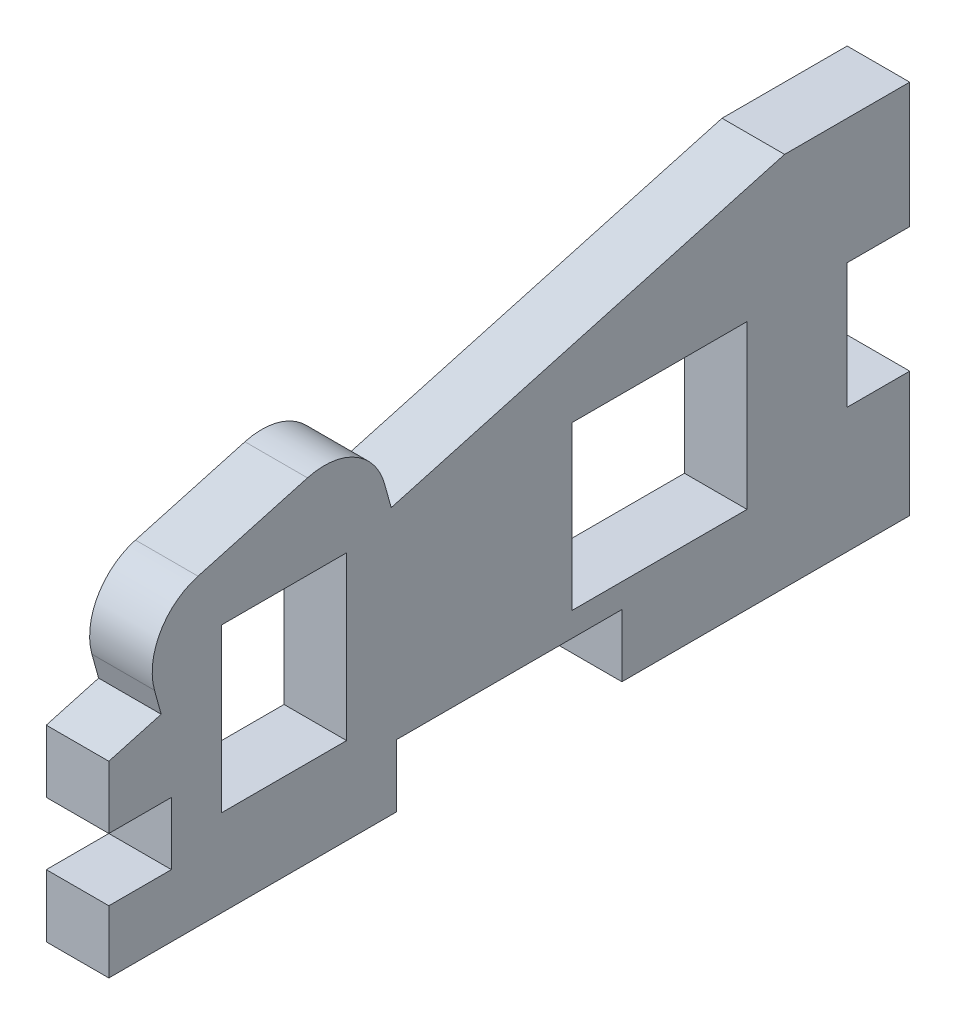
ISO-10303-21;
HEADER;
FILE_DESCRIPTION(('STEP AP214'),'2;1');
FILE_NAME('part.step','',(''),(''),'','','');
FILE_SCHEMA(('AUTOMOTIVE_DESIGN { 1 0 10303 214 1 1 1 1 }'));
ENDSEC;
DATA;
#1=APPLICATION_CONTEXT('core data for automotive mechanical design processes');
#2=APPLICATION_PROTOCOL_DEFINITION('international standard','automotive_design',2000,#1);
#3=PRODUCT_CONTEXT('',#1,'mechanical');
#4=PRODUCT('Part','Part','',(#3));
#5=PRODUCT_RELATED_PRODUCT_CATEGORY('part','',(#4));
#6=PRODUCT_DEFINITION_FORMATION('','',#4);
#7=PRODUCT_DEFINITION_CONTEXT('part definition',#1,'design');
#8=PRODUCT_DEFINITION('design','',#6,#7);
#9=PRODUCT_DEFINITION_SHAPE('','',#8);
#10=(LENGTH_UNIT() NAMED_UNIT(*) SI_UNIT(.MILLI.,.METRE.));
#11=(NAMED_UNIT(*) PLANE_ANGLE_UNIT() SI_UNIT($,.RADIAN.));
#12=(NAMED_UNIT(*) SI_UNIT($,.STERADIAN.) SOLID_ANGLE_UNIT());
#13=UNCERTAINTY_MEASURE_WITH_UNIT(LENGTH_MEASURE(1.E-05),#10,'distance_accuracy_value','');
#14=(GEOMETRIC_REPRESENTATION_CONTEXT(3) GLOBAL_UNCERTAINTY_ASSIGNED_CONTEXT((#13)) GLOBAL_UNIT_ASSIGNED_CONTEXT((#10,
#11,#12)) REPRESENTATION_CONTEXT('',''));
#15=CARTESIAN_POINT('',(0.,0.,0.));
#16=DIRECTION('',(0.,0.,1.));
#17=DIRECTION('',(1.,0.,0.));
#18=AXIS2_PLACEMENT_3D('',#15,#16,#17);
#19=CARTESIAN_POINT('',(5.,5.,19.6666666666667));
#20=DIRECTION('',(0.,-0.963517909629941,-0.267643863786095));
#21=DIRECTION('',(0.,0.267643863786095,-0.963517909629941));
#22=AXIS2_PLACEMENT_3D('',#19,#20,#21);
#23=PLANE('',#22);
#24=DIRECTION('',(0.,-0.267643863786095,0.963517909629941));
#25=VECTOR('',#24,1.);
#26=CARTESIAN_POINT('',(5.,5.,19.6666666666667));
#27=LINE('',#26,#25);
#28=CARTESIAN_POINT('',(5.,6.16178068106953,15.4842562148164));
#29=VERTEX_POINT('',#28);
#30=CARTESIAN_POINT('',(5.,5.,19.6666666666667));
#31=VERTEX_POINT('',#30);
#32=EDGE_CURVE('E417',#29,#31,#27,.T.);
#33=ORIENTED_EDGE('',*,*,#32,.F.);
#34=DIRECTION('',(1.,0.,0.));
#35=VECTOR('',#34,1.);
#36=CARTESIAN_POINT('',(-23.468724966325,6.16178068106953,15.4842562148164));
#37=LINE('',#36,#35);
#38=CARTESIAN_POINT('',(0.,6.16178068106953,15.4842562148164));
#39=VERTEX_POINT('',#38);
#40=EDGE_CURVE('E262',#39,#29,#37,.T.);
#41=ORIENTED_EDGE('',*,*,#40,.F.);
#42=DIRECTION('',(0.,-0.267643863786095,0.963517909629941));
#43=VECTOR('',#42,1.);
#44=CARTESIAN_POINT('',(0.,5.,19.6666666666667));
#45=LINE('',#44,#43);
#46=CARTESIAN_POINT('',(0.,5.,19.6666666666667));
#47=VERTEX_POINT('',#46);
#48=EDGE_CURVE('E433',#39,#47,#45,.T.);
#49=ORIENTED_EDGE('',*,*,#48,.T.);
#50=DIRECTION('',(-1.,0.,0.));
#51=VECTOR('',#50,1.);
#52=CARTESIAN_POINT('',(5.,5.,19.6666666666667));
#53=LINE('',#52,#51);
#54=EDGE_CURVE('E446',#31,#47,#53,.T.);
#55=ORIENTED_EDGE('',*,*,#54,.F.);
#56=EDGE_LOOP('',(#33,#41,#49,#55));
#57=FACE_BOUND('',#56,.T.);
#58=ADVANCED_FACE('F32',(#57),#23,.F.);
#59=CARTESIAN_POINT('',(5.,5.,19.6666666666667));
#60=DIRECTION('',(0.,0.,-1.));
#61=DIRECTION('',(0.,1.,0.));
#62=AXIS2_PLACEMENT_3D('',#59,#60,#61);
#63=PLANE('',#62);
#64=DIRECTION('',(0.,-1.,0.));
#65=VECTOR('',#64,1.);
#66=CARTESIAN_POINT('',(0.,5.,19.6666666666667));
#67=LINE('',#66,#65);
#68=CARTESIAN_POINT('',(0.,0.,19.6666666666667));
#69=VERTEX_POINT('',#68);
#70=EDGE_CURVE('E438',#47,#69,#67,.T.);
#71=ORIENTED_EDGE('',*,*,#70,.T.);
#72=DIRECTION('',(1.,0.,0.));
#73=VECTOR('',#72,1.);
#74=CARTESIAN_POINT('',(0.,0.,19.6666666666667));
#75=LINE('',#74,#73);
#76=CARTESIAN_POINT('',(5.,0.,19.6666666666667));
#77=VERTEX_POINT('',#76);
#78=EDGE_CURVE('E326',#69,#77,#75,.T.);
#79=ORIENTED_EDGE('',*,*,#78,.T.);
#80=DIRECTION('',(0.,-1.,0.));
#81=VECTOR('',#80,1.);
#82=CARTESIAN_POINT('',(5.,5.,19.6666666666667));
#83=LINE('',#82,#81);
#84=EDGE_CURVE('E422',#31,#77,#83,.T.);
#85=ORIENTED_EDGE('',*,*,#84,.F.);
#86=ORIENTED_EDGE('',*,*,#54,.T.);
#87=EDGE_LOOP('',(#71,#79,#85,#86));
#88=FACE_BOUND('',#87,.T.);
#89=ADVANCED_FACE('F501',(#88),#63,.F.);
#90=CARTESIAN_POINT('',(5.,-10.,19.6666666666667));
#91=DIRECTION('',(0.,1.,0.));
#92=DIRECTION('',(0.,0.,1.));
#93=AXIS2_PLACEMENT_3D('',#90,#91,#92);
#94=PLANE('',#93);
#95=DIRECTION('',(0.,0.,-1.));
#96=VECTOR('',#95,1.);
#97=CARTESIAN_POINT('',(0.,-10.,19.6666666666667));
#98=LINE('',#97,#96);
#99=CARTESIAN_POINT('',(0.,-10.,19.6666666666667));
#100=VERTEX_POINT('',#99);
#101=CARTESIAN_POINT('',(0.,-10.,-3.33333333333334));
#102=VERTEX_POINT('',#101);
#103=EDGE_CURVE('E415',#100,#102,#98,.T.);
#104=ORIENTED_EDGE('',*,*,#103,.T.);
#105=DIRECTION('',(1.,0.,0.));
#106=VECTOR('',#105,1.);
#107=CARTESIAN_POINT('',(0.,-10.,-3.33333333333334));
#108=LINE('',#107,#106);
#109=CARTESIAN_POINT('',(5.,-10.,-3.33333333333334));
#110=VERTEX_POINT('',#109);
#111=EDGE_CURVE('E332',#102,#110,#108,.T.);
#112=ORIENTED_EDGE('',*,*,#111,.T.);
#113=DIRECTION('',(0.,0.,-1.));
#114=VECTOR('',#113,1.);
#115=CARTESIAN_POINT('',(5.,-10.,19.6666666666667));
#116=LINE('',#115,#114);
#117=CARTESIAN_POINT('',(5.,-10.,19.6666666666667));
#118=VERTEX_POINT('',#117);
#119=EDGE_CURVE('E426',#118,#110,#116,.T.);
#120=ORIENTED_EDGE('',*,*,#119,.F.);
#121=DIRECTION('',(-1.,0.,0.));
#122=VECTOR('',#121,1.);
#123=CARTESIAN_POINT('',(5.,-10.,19.6666666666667));
#124=LINE('',#123,#122);
#125=EDGE_CURVE('E429',#118,#100,#124,.T.);
#126=ORIENTED_EDGE('',*,*,#125,.T.);
#127=EDGE_LOOP('',(#104,#112,#120,#126));
#128=FACE_BOUND('',#127,.T.);
#129=ADVANCED_FACE('F520',(#128),#94,.F.);
#130=CARTESIAN_POINT('',(5.,20.,-39.3333333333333));
#131=DIRECTION('',(0.,0.,1.));
#132=DIRECTION('',(1.,0.,0.));
#133=AXIS2_PLACEMENT_3D('',#130,#131,#132);
#134=PLANE('',#133);
#135=DIRECTION('',(0.,1.,0.));
#136=VECTOR('',#135,1.);
#137=CARTESIAN_POINT('',(5.,20.,-39.3333333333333));
#138=LINE('',#137,#136);
#139=CARTESIAN_POINT('',(5.,0.,-39.3333333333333));
#140=VERTEX_POINT('',#139);
#141=CARTESIAN_POINT('',(5.,10.,-39.3333333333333));
#142=VERTEX_POINT('',#141);
#143=EDGE_CURVE('E412',#140,#142,#138,.T.);
#144=ORIENTED_EDGE('',*,*,#143,.F.);
#145=DIRECTION('',(1.,0.,0.));
#146=VECTOR('',#145,1.);
#147=CARTESIAN_POINT('',(-11.180339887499,0.,-39.3333333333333));
#148=LINE('',#147,#146);
#149=CARTESIAN_POINT('',(0.,0.,-39.3333333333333));
#150=VERTEX_POINT('',#149);
#151=EDGE_CURVE('E387',#150,#140,#148,.T.);
#152=ORIENTED_EDGE('',*,*,#151,.F.);
#153=DIRECTION('',(0.,1.,0.));
#154=VECTOR('',#153,1.);
#155=CARTESIAN_POINT('',(0.,20.,-39.3333333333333));
#156=LINE('',#155,#154);
#157=CARTESIAN_POINT('',(0.,10.,-39.3333333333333));
#158=VERTEX_POINT('',#157);
#159=EDGE_CURVE('E411',#150,#158,#156,.T.);
#160=ORIENTED_EDGE('',*,*,#159,.T.);
#161=DIRECTION('',(1.,0.,0.));
#162=VECTOR('',#161,1.);
#163=CARTESIAN_POINT('',(-11.180339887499,10.,-39.3333333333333));
#164=LINE('',#163,#162);
#165=EDGE_CURVE('E402',#158,#142,#164,.T.);
#166=ORIENTED_EDGE('',*,*,#165,.T.);
#167=EDGE_LOOP('',(#144,#152,#160,#166));
#168=FACE_BOUND('',#167,.T.);
#169=ADVANCED_FACE('F549',(#168),#134,.F.);
#170=CARTESIAN_POINT('',(5.,20.,-34.3333333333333));
#171=DIRECTION('',(0.,-1.,0.));
#172=DIRECTION('',(0.,0.,-1.));
#173=AXIS2_PLACEMENT_3D('',#170,#171,#172);
#174=PLANE('',#173);
#175=DIRECTION('',(0.,0.,1.));
#176=VECTOR('',#175,1.);
#177=CARTESIAN_POINT('',(0.,20.,-34.3333333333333));
#178=LINE('',#177,#176);
#179=CARTESIAN_POINT('',(0.,20.,-44.3333333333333));
#180=VERTEX_POINT('',#179);
#181=CARTESIAN_POINT('',(0.,20.,-34.3333333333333));
#182=VERTEX_POINT('',#181);
#183=EDGE_CURVE('E431',#180,#182,#178,.T.);
#184=ORIENTED_EDGE('',*,*,#183,.T.);
#185=DIRECTION('',(-1.,0.,0.));
#186=VECTOR('',#185,1.);
#187=CARTESIAN_POINT('',(5.,20.,-34.3333333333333));
#188=LINE('',#187,#186);
#189=CARTESIAN_POINT('',(5.,20.,-34.3333333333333));
#190=VERTEX_POINT('',#189);
#191=EDGE_CURVE('E449',#190,#182,#188,.T.);
#192=ORIENTED_EDGE('',*,*,#191,.F.);
#193=DIRECTION('',(0.,0.,1.));
#194=VECTOR('',#193,1.);
#195=CARTESIAN_POINT('',(5.,20.,-34.3333333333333));
#196=LINE('',#195,#194);
#197=CARTESIAN_POINT('',(5.,20.,-44.3333333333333));
#198=VERTEX_POINT('',#197);
#199=EDGE_CURVE('E414',#198,#190,#196,.T.);
#200=ORIENTED_EDGE('',*,*,#199,.F.);
#201=DIRECTION('',(1.,0.,0.));
#202=VECTOR('',#201,1.);
#203=CARTESIAN_POINT('',(-11.180339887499,20.,-44.3333333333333));
#204=LINE('',#203,#202);
#205=EDGE_CURVE('E396',#180,#198,#204,.T.);
#206=ORIENTED_EDGE('',*,*,#205,.F.);
#207=EDGE_LOOP('',(#184,#192,#200,#206));
#208=FACE_BOUND('',#207,.T.);
#209=ADVANCED_FACE('F564',(#208),#174,.F.);
#210=CARTESIAN_POINT('',(0.,11.2682193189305,-2.89892288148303));
#211=VERTEX_POINT('',#210);
#212=EDGE_CURVE('E434',#182,#211,#45,.T.);
#213=ORIENTED_EDGE('',*,*,#212,.T.);
#214=DIRECTION('',(1.,0.,0.));
#215=VECTOR('',#214,1.);
#216=CARTESIAN_POINT('',(-23.468724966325,11.2682193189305,-2.89892288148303));
#217=LINE('',#216,#215);
#218=CARTESIAN_POINT('',(5.,11.2682193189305,-2.89892288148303));
#219=VERTEX_POINT('',#218);
#220=EDGE_CURVE('E261',#211,#219,#217,.T.);
#221=ORIENTED_EDGE('',*,*,#220,.T.);
#222=EDGE_CURVE('E418',#190,#219,#27,.T.);
#223=ORIENTED_EDGE('',*,*,#222,.F.);
#224=ORIENTED_EDGE('',*,*,#191,.T.);
#225=EDGE_LOOP('',(#213,#221,#223,#224));
#226=FACE_BOUND('',#225,.T.);
#227=ADVANCED_FACE('F566',(#226),#23,.F.);
#228=CARTESIAN_POINT('',(5.,-5.,19.6666666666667));
#229=VERTEX_POINT('',#228);
#230=EDGE_CURVE('E421',#229,#118,#83,.T.);
#231=ORIENTED_EDGE('',*,*,#230,.F.);
#232=DIRECTION('',(1.,0.,0.));
#233=VECTOR('',#232,1.);
#234=CARTESIAN_POINT('',(0.,-5.,19.6666666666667));
#235=LINE('',#234,#233);
#236=CARTESIAN_POINT('',(0.,-5.,19.6666666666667));
#237=VERTEX_POINT('',#236);
#238=EDGE_CURVE('E352',#237,#229,#235,.T.);
#239=ORIENTED_EDGE('',*,*,#238,.F.);
#240=EDGE_CURVE('E437',#237,#100,#67,.T.);
#241=ORIENTED_EDGE('',*,*,#240,.T.);
#242=ORIENTED_EDGE('',*,*,#125,.F.);
#243=EDGE_LOOP('',(#231,#239,#241,#242));
#244=FACE_BOUND('',#243,.T.);
#245=ADVANCED_FACE('F516',(#244),#63,.F.);
#246=CARTESIAN_POINT('',(5.,-10.,-21.3333333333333));
#247=VERTEX_POINT('',#246);
#248=CARTESIAN_POINT('',(5.,-10.,-44.3333333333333));
#249=VERTEX_POINT('',#248);
#250=EDGE_CURVE('E425',#247,#249,#116,.T.);
#251=ORIENTED_EDGE('',*,*,#250,.F.);
#252=DIRECTION('',(1.,0.,0.));
#253=VECTOR('',#252,1.);
#254=CARTESIAN_POINT('',(0.,-10.,-21.3333333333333));
#255=LINE('',#254,#253);
#256=CARTESIAN_POINT('',(0.,-10.,-21.3333333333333));
#257=VERTEX_POINT('',#256);
#258=EDGE_CURVE('E340',#257,#247,#255,.T.);
#259=ORIENTED_EDGE('',*,*,#258,.F.);
#260=CARTESIAN_POINT('',(0.,-10.,-44.3333333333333));
#261=VERTEX_POINT('',#260);
#262=EDGE_CURVE('E441',#257,#261,#98,.T.);
#263=ORIENTED_EDGE('',*,*,#262,.T.);
#264=DIRECTION('',(1.,0.,0.));
#265=VECTOR('',#264,1.);
#266=CARTESIAN_POINT('',(-11.180339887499,-10.,-44.3333333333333));
#267=LINE('',#266,#265);
#268=EDGE_CURVE('E378',#261,#249,#267,.T.);
#269=ORIENTED_EDGE('',*,*,#268,.T.);
#270=EDGE_LOOP('',(#251,#259,#263,#269));
#271=FACE_BOUND('',#270,.T.);
#272=ADVANCED_FACE('F538',(#271),#94,.F.);
#273=CARTESIAN_POINT('',(5.,0.,0.));
#274=DIRECTION('',(1.,0.,0.));
#275=DIRECTION('',(0.,0.,-1.));
#276=AXIS2_PLACEMENT_3D('',#273,#274,#275);
#277=PLANE('',#276);
#278=DIRECTION('',(0.,0.963517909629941,0.267643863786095));
#279=VECTOR('',#278,1.);
#280=CARTESIAN_POINT('',(5.,18.0128446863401,-1.02541583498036));
#281=LINE('',#280,#279);
#282=CARTESIAN_POINT('',(5.,13.1952551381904,-2.36363515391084));
#283=VERTEX_POINT('',#282);
#284=EDGE_CURVE('E483',#219,#283,#281,.T.);
#285=ORIENTED_EDGE('',*,*,#284,.T.);
#286=CARTESIAN_POINT('',(5.,11.8570358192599,2.45395439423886));
#287=DIRECTION('',(1.,0.,0.));
#288=DIRECTION('',(0.,0.,-1.));
#289=AXIS2_PLACEMENT_3D('',#286,#287,#288);
#290=CIRCLE('',#289,5.);
#291=CARTESIAN_POINT('',(5.,16.6746253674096,3.79217371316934));
#292=VERTEX_POINT('',#291);
#293=EDGE_CURVE('E458',#283,#292,#290,.T.);
#294=ORIENTED_EDGE('',*,*,#293,.T.);
#295=DIRECTION('',(0.,-0.267643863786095,0.963517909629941));
#296=VECTOR('',#295,1.);
#297=CARTESIAN_POINT('',(5.,12.9064060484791,17.357763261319));
#298=LINE('',#297,#296);
#299=CARTESIAN_POINT('',(5.,14.2446253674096,12.5401737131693));
#300=VERTEX_POINT('',#299);
#301=EDGE_CURVE('E482',#292,#300,#298,.T.);
#302=ORIENTED_EDGE('',*,*,#301,.T.);
#303=CARTESIAN_POINT('',(5.,9.42703581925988,11.2019543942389));
#304=DIRECTION('',(1.,0.,0.));
#305=DIRECTION('',(0.,0.,-1.));
#306=AXIS2_PLACEMENT_3D('',#303,#304,#305);
#307=CIRCLE('',#306,5.);
#308=CARTESIAN_POINT('',(5.,8.08881650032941,16.0195439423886));
#309=VERTEX_POINT('',#308);
#310=EDGE_CURVE('E456',#300,#309,#307,.T.);
#311=ORIENTED_EDGE('',*,*,#310,.T.);
#312=DIRECTION('',(0.,-0.963517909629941,-0.267643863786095));
#313=VECTOR('',#312,1.);
#314=CARTESIAN_POINT('',(5.,6.16178068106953,15.4842562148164));
#315=LINE('',#314,#313);
#316=EDGE_CURVE('E267',#309,#29,#315,.T.);
#317=ORIENTED_EDGE('',*,*,#316,.T.);
#318=ORIENTED_EDGE('',*,*,#32,.T.);
#319=ORIENTED_EDGE('',*,*,#84,.T.);
#320=DIRECTION('',(0.,0.,1.));
#321=VECTOR('',#320,1.);
#322=CARTESIAN_POINT('',(5.,0.,0.));
#323=LINE('',#322,#321);
#324=CARTESIAN_POINT('',(5.,0.,14.6666666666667));
#325=VERTEX_POINT('',#324);
#326=EDGE_CURVE('E365',#325,#77,#323,.T.);
#327=ORIENTED_EDGE('',*,*,#326,.F.);
#328=DIRECTION('',(0.,1.,0.));
#329=VECTOR('',#328,1.);
#330=CARTESIAN_POINT('',(5.,0.,14.6666666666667));
#331=LINE('',#330,#329);
#332=CARTESIAN_POINT('',(5.,-5.,14.6666666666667));
#333=VERTEX_POINT('',#332);
#334=EDGE_CURVE('E363',#333,#325,#331,.T.);
#335=ORIENTED_EDGE('',*,*,#334,.F.);
#336=DIRECTION('',(0.,0.,-1.));
#337=VECTOR('',#336,1.);
#338=CARTESIAN_POINT('',(5.,-5.,0.));
#339=LINE('',#338,#337);
#340=EDGE_CURVE('E336',#229,#333,#339,.T.);
#341=ORIENTED_EDGE('',*,*,#340,.F.);
#342=ORIENTED_EDGE('',*,*,#230,.T.);
#343=ORIENTED_EDGE('',*,*,#119,.T.);
#344=DIRECTION('',(0.,-1.,0.));
#345=VECTOR('',#344,1.);
#346=CARTESIAN_POINT('',(5.,0.,-3.33333333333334));
#347=LINE('',#346,#345);
#348=CARTESIAN_POINT('',(5.,-4.99999999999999,-3.33333333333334));
#349=VERTEX_POINT('',#348);
#350=EDGE_CURVE('E371',#349,#110,#347,.T.);
#351=ORIENTED_EDGE('',*,*,#350,.F.);
#352=DIRECTION('',(0.,0.,1.));
#353=VECTOR('',#352,1.);
#354=CARTESIAN_POINT('',(5.,-4.99999999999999,0.));
#355=LINE('',#354,#353);
#356=CARTESIAN_POINT('',(5.,-4.99999999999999,-21.3333333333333));
#357=VERTEX_POINT('',#356);
#358=EDGE_CURVE('E369',#357,#349,#355,.T.);
#359=ORIENTED_EDGE('',*,*,#358,.F.);
#360=DIRECTION('',(0.,1.,0.));
#361=VECTOR('',#360,1.);
#362=CARTESIAN_POINT('',(5.,0.,-21.3333333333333));
#363=LINE('',#362,#361);
#364=EDGE_CURVE('E367',#247,#357,#363,.T.);
#365=ORIENTED_EDGE('',*,*,#364,.F.);
#366=ORIENTED_EDGE('',*,*,#250,.T.);
#367=DIRECTION('',(0.,1.,0.));
#368=VECTOR('',#367,1.);
#369=CARTESIAN_POINT('',(5.,0.,-44.3333333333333));
#370=LINE('',#369,#368);
#371=CARTESIAN_POINT('',(5.,0.,-44.3333333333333));
#372=VERTEX_POINT('',#371);
#373=EDGE_CURVE('E373',#249,#372,#370,.T.);
#374=ORIENTED_EDGE('',*,*,#373,.T.);
#375=DIRECTION('',(0.,0.,1.));
#376=VECTOR('',#375,1.);
#377=CARTESIAN_POINT('',(5.,0.,-39.3333333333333));
#378=LINE('',#377,#376);
#379=EDGE_CURVE('E381',#372,#140,#378,.T.);
#380=ORIENTED_EDGE('',*,*,#379,.T.);
#381=ORIENTED_EDGE('',*,*,#143,.T.);
#382=DIRECTION('',(0.,0.,-1.));
#383=VECTOR('',#382,1.);
#384=CARTESIAN_POINT('',(5.,10.,-39.3333333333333));
#385=LINE('',#384,#383);
#386=CARTESIAN_POINT('',(5.,10.,-44.3333333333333));
#387=VERTEX_POINT('',#386);
#388=EDGE_CURVE('E392',#142,#387,#385,.T.);
#389=ORIENTED_EDGE('',*,*,#388,.T.);
#390=DIRECTION('',(0.,1.,0.));
#391=VECTOR('',#390,1.);
#392=CARTESIAN_POINT('',(5.,20.,-44.3333333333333));
#393=LINE('',#392,#391);
#394=EDGE_CURVE('E399',#387,#198,#393,.T.);
#395=ORIENTED_EDGE('',*,*,#394,.T.);
#396=ORIENTED_EDGE('',*,*,#199,.T.);
#397=ORIENTED_EDGE('',*,*,#222,.T.);
#398=EDGE_LOOP('',(#285,#294,#302,#311,#317,#318,#319,#327,#335,#341,#342,#343,#351,#359,#365,
#366,#374,#380,#381,#389,#395,#396,#397));
#399=FACE_BOUND('',#398,.T.);
#400=DIRECTION('',(0.,1.,0.));
#401=VECTOR('',#400,1.);
#402=CARTESIAN_POINT('',(5.,0.,-31.3333333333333));
#403=LINE('',#402,#401);
#404=CARTESIAN_POINT('',(5.,-3.06999999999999,-31.3333333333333));
#405=VERTEX_POINT('',#404);
#406=CARTESIAN_POINT('',(5.,9.93000000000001,-31.3333333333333));
#407=VERTEX_POINT('',#406);
#408=EDGE_CURVE('E318',#405,#407,#403,.T.);
#409=ORIENTED_EDGE('',*,*,#408,.F.);
#410=DIRECTION('',(0.,0.,-1.));
#411=VECTOR('',#410,1.);
#412=CARTESIAN_POINT('',(5.,-3.07,0.));
#413=LINE('',#412,#411);
#414=CARTESIAN_POINT('',(5.,-3.07,-17.3333333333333));
#415=VERTEX_POINT('',#414);
#416=EDGE_CURVE('E316',#415,#405,#413,.T.);
#417=ORIENTED_EDGE('',*,*,#416,.F.);
#418=DIRECTION('',(0.,-1.,0.));
#419=VECTOR('',#418,1.);
#420=CARTESIAN_POINT('',(5.,0.,-17.3333333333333));
#421=LINE('',#420,#419);
#422=CARTESIAN_POINT('',(5.,9.93,-17.3333333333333));
#423=VERTEX_POINT('',#422);
#424=EDGE_CURVE('E314',#423,#415,#421,.T.);
#425=ORIENTED_EDGE('',*,*,#424,.F.);
#426=DIRECTION('',(0.,0.,1.));
#427=VECTOR('',#426,1.);
#428=CARTESIAN_POINT('',(5.,9.93,0.));
#429=LINE('',#428,#427);
#430=EDGE_CURVE('E246',#407,#423,#429,.T.);
#431=ORIENTED_EDGE('',*,*,#430,.F.);
#432=EDGE_LOOP('',(#409,#417,#425,#431));
#433=FACE_BOUND('',#432,.T.);
#434=DIRECTION('',(0.,-1.,0.));
#435=VECTOR('',#434,1.);
#436=CARTESIAN_POINT('',(5.,0.,10.6666666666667));
#437=LINE('',#436,#435);
#438=CARTESIAN_POINT('',(5.,9.93,10.6666666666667));
#439=VERTEX_POINT('',#438);
#440=CARTESIAN_POINT('',(5.,-3.07,10.6666666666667));
#441=VERTEX_POINT('',#440);
#442=EDGE_CURVE('E237',#439,#441,#437,.T.);
#443=ORIENTED_EDGE('',*,*,#442,.F.);
#444=DIRECTION('',(0.,0.,1.));
#445=VECTOR('',#444,1.);
#446=CARTESIAN_POINT('',(5.,9.93,0.));
#447=LINE('',#446,#445);
#448=CARTESIAN_POINT('',(5.,9.93,0.666666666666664));
#449=VERTEX_POINT('',#448);
#450=EDGE_CURVE('E241',#449,#439,#447,.T.);
#451=ORIENTED_EDGE('',*,*,#450,.F.);
#452=DIRECTION('',(0.,1.,0.));
#453=VECTOR('',#452,1.);
#454=CARTESIAN_POINT('',(5.,0.,0.666666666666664));
#455=LINE('',#454,#453);
#456=CARTESIAN_POINT('',(5.,-3.07,0.666666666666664));
#457=VERTEX_POINT('',#456);
#458=EDGE_CURVE('E255',#457,#449,#455,.T.);
#459=ORIENTED_EDGE('',*,*,#458,.F.);
#460=DIRECTION('',(0.,0.,-1.));
#461=VECTOR('',#460,1.);
#462=CARTESIAN_POINT('',(5.,-3.07,0.));
#463=LINE('',#462,#461);
#464=EDGE_CURVE('E242',#441,#457,#463,.T.);
#465=ORIENTED_EDGE('',*,*,#464,.F.);
#466=EDGE_LOOP('',(#443,#451,#459,#465));
#467=FACE_BOUND('',#466,.T.);
#468=ADVANCED_FACE('F239',(#399,#433,#467),#277,.T.);
#469=CARTESIAN_POINT('',(0.,0.,0.));
#470=DIRECTION('',(1.,0.,0.));
#471=DIRECTION('',(0.,0.,-1.));
#472=AXIS2_PLACEMENT_3D('',#469,#470,#471);
#473=PLANE('',#472);
#474=DIRECTION('',(0.,0.,1.));
#475=VECTOR('',#474,1.);
#476=CARTESIAN_POINT('',(0.,9.93,10.6666666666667));
#477=LINE('',#476,#475);
#478=CARTESIAN_POINT('',(0.,9.93,0.666666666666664));
#479=VERTEX_POINT('',#478);
#480=CARTESIAN_POINT('',(0.,9.93,10.6666666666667));
#481=VERTEX_POINT('',#480);
#482=EDGE_CURVE('E303',#479,#481,#477,.T.);
#483=ORIENTED_EDGE('',*,*,#482,.T.);
#484=DIRECTION('',(0.,-1.,0.));
#485=VECTOR('',#484,1.);
#486=CARTESIAN_POINT('',(0.,0.,10.6666666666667));
#487=LINE('',#486,#485);
#488=CARTESIAN_POINT('',(0.,-3.07,10.6666666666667));
#489=VERTEX_POINT('',#488);
#490=EDGE_CURVE('E259',#481,#489,#487,.T.);
#491=ORIENTED_EDGE('',*,*,#490,.T.);
#492=DIRECTION('',(0.,0.,-1.));
#493=VECTOR('',#492,1.);
#494=CARTESIAN_POINT('',(0.,-3.07,10.6666666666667));
#495=LINE('',#494,#493);
#496=CARTESIAN_POINT('',(0.,-3.07,0.666666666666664));
#497=VERTEX_POINT('',#496);
#498=EDGE_CURVE('E273',#489,#497,#495,.T.);
#499=ORIENTED_EDGE('',*,*,#498,.T.);
#500=DIRECTION('',(0.,1.,0.));
#501=VECTOR('',#500,1.);
#502=CARTESIAN_POINT('',(0.,-3.07,0.666666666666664));
#503=LINE('',#502,#501);
#504=EDGE_CURVE('E300',#497,#479,#503,.T.);
#505=ORIENTED_EDGE('',*,*,#504,.T.);
#506=EDGE_LOOP('',(#483,#491,#499,#505));
#507=FACE_BOUND('',#506,.T.);
#508=DIRECTION('',(0.,0.,-1.));
#509=VECTOR('',#508,1.);
#510=CARTESIAN_POINT('',(0.,-3.06999999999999,-31.3333333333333));
#511=LINE('',#510,#509);
#512=CARTESIAN_POINT('',(0.,-3.07,-17.3333333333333));
#513=VERTEX_POINT('',#512);
#514=CARTESIAN_POINT('',(0.,-3.06999999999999,-31.3333333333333));
#515=VERTEX_POINT('',#514);
#516=EDGE_CURVE('E284',#513,#515,#511,.T.);
#517=ORIENTED_EDGE('',*,*,#516,.T.);
#518=DIRECTION('',(0.,1.,0.));
#519=VECTOR('',#518,1.);
#520=CARTESIAN_POINT('',(0.,-3.06999999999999,-31.3333333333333));
#521=LINE('',#520,#519);
#522=CARTESIAN_POINT('',(0.,9.93000000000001,-31.3333333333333));
#523=VERTEX_POINT('',#522);
#524=EDGE_CURVE('E275',#515,#523,#521,.T.);
#525=ORIENTED_EDGE('',*,*,#524,.T.);
#526=DIRECTION('',(0.,0.,1.));
#527=VECTOR('',#526,1.);
#528=CARTESIAN_POINT('',(0.,9.93000000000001,-31.3333333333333));
#529=LINE('',#528,#527);
#530=CARTESIAN_POINT('',(0.,9.93,-17.3333333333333));
#531=VERTEX_POINT('',#530);
#532=EDGE_CURVE('E278',#523,#531,#529,.T.);
#533=ORIENTED_EDGE('',*,*,#532,.T.);
#534=DIRECTION('',(0.,-1.,0.));
#535=VECTOR('',#534,1.);
#536=CARTESIAN_POINT('',(0.,-3.07,-17.3333333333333));
#537=LINE('',#536,#535);
#538=EDGE_CURVE('E281',#531,#513,#537,.T.);
#539=ORIENTED_EDGE('',*,*,#538,.T.);
#540=EDGE_LOOP('',(#517,#525,#533,#539));
#541=FACE_BOUND('',#540,.T.);
#542=DIRECTION('',(0.,0.267643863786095,-0.963517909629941));
#543=VECTOR('',#542,1.);
#544=CARTESIAN_POINT('',(0.,12.9064060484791,17.357763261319));
#545=LINE('',#544,#543);
#546=CARTESIAN_POINT('',(0.,14.2446253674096,12.5401737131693));
#547=VERTEX_POINT('',#546);
#548=CARTESIAN_POINT('',(0.,16.6746253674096,3.79217371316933));
#549=VERTEX_POINT('',#548);
#550=EDGE_CURVE('E271',#547,#549,#545,.T.);
#551=ORIENTED_EDGE('',*,*,#550,.T.);
#552=CARTESIAN_POINT('',(0.,11.8570358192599,2.45395439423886));
#553=DIRECTION('',(1.,0.,0.));
#554=DIRECTION('',(0.,0.,-1.));
#555=AXIS2_PLACEMENT_3D('',#552,#553,#554);
#556=CIRCLE('',#555,5.);
#557=CARTESIAN_POINT('',(0.,13.1952551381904,-2.36363515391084));
#558=VERTEX_POINT('',#557);
#559=EDGE_CURVE('E40',#549,#558,#556,.F.);
#560=ORIENTED_EDGE('',*,*,#559,.T.);
#561=DIRECTION('',(0.,-0.963517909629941,-0.267643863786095));
#562=VECTOR('',#561,1.);
#563=CARTESIAN_POINT('',(0.,18.0128446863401,-1.02541583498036));
#564=LINE('',#563,#562);
#565=EDGE_CURVE('E274',#558,#211,#564,.T.);
#566=ORIENTED_EDGE('',*,*,#565,.T.);
#567=ORIENTED_EDGE('',*,*,#212,.F.);
#568=ORIENTED_EDGE('',*,*,#183,.F.);
#569=DIRECTION('',(0.,-1.,0.));
#570=VECTOR('',#569,1.);
#571=CARTESIAN_POINT('',(0.,20.,-44.3333333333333));
#572=LINE('',#571,#570);
#573=CARTESIAN_POINT('',(0.,10.,-44.3333333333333));
#574=VERTEX_POINT('',#573);
#575=EDGE_CURVE('E393',#180,#574,#572,.T.);
#576=ORIENTED_EDGE('',*,*,#575,.T.);
#577=DIRECTION('',(0.,0.,1.));
#578=VECTOR('',#577,1.);
#579=CARTESIAN_POINT('',(0.,10.,-39.3333333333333));
#580=LINE('',#579,#578);
#581=EDGE_CURVE('E395',#574,#158,#580,.T.);
#582=ORIENTED_EDGE('',*,*,#581,.T.);
#583=ORIENTED_EDGE('',*,*,#159,.F.);
#584=DIRECTION('',(0.,0.,-1.));
#585=VECTOR('',#584,1.);
#586=CARTESIAN_POINT('',(0.,0.,-39.3333333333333));
#587=LINE('',#586,#585);
#588=CARTESIAN_POINT('',(0.,0.,-44.3333333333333));
#589=VERTEX_POINT('',#588);
#590=EDGE_CURVE('E377',#150,#589,#587,.T.);
#591=ORIENTED_EDGE('',*,*,#590,.T.);
#592=DIRECTION('',(0.,-1.,0.));
#593=VECTOR('',#592,1.);
#594=CARTESIAN_POINT('',(0.,0.,-44.3333333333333));
#595=LINE('',#594,#593);
#596=EDGE_CURVE('E374',#589,#261,#595,.T.);
#597=ORIENTED_EDGE('',*,*,#596,.T.);
#598=ORIENTED_EDGE('',*,*,#262,.F.);
#599=DIRECTION('',(0.,1.,0.));
#600=VECTOR('',#599,1.);
#601=CARTESIAN_POINT('',(0.,-10.,-21.3333333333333));
#602=LINE('',#601,#600);
#603=CARTESIAN_POINT('',(0.,-4.99999999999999,-21.3333333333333));
#604=VERTEX_POINT('',#603);
#605=EDGE_CURVE('E325',#257,#604,#602,.T.);
#606=ORIENTED_EDGE('',*,*,#605,.T.);
#607=DIRECTION('',(0.,0.,1.));
#608=VECTOR('',#607,1.);
#609=CARTESIAN_POINT('',(0.,-4.99999999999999,-3.33333333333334));
#610=LINE('',#609,#608);
#611=CARTESIAN_POINT('',(0.,-4.99999999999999,-3.33333333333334));
#612=VERTEX_POINT('',#611);
#613=EDGE_CURVE('E329',#604,#612,#610,.T.);
#614=ORIENTED_EDGE('',*,*,#613,.T.);
#615=DIRECTION('',(0.,-1.,0.));
#616=VECTOR('',#615,1.);
#617=CARTESIAN_POINT('',(0.,-10.,-3.33333333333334));
#618=LINE('',#617,#616);
#619=EDGE_CURVE('E322',#612,#102,#618,.T.);
#620=ORIENTED_EDGE('',*,*,#619,.T.);
#621=ORIENTED_EDGE('',*,*,#103,.F.);
#622=ORIENTED_EDGE('',*,*,#240,.F.);
#623=DIRECTION('',(0.,0.,-1.));
#624=VECTOR('',#623,1.);
#625=CARTESIAN_POINT('',(0.,-5.,19.6666666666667));
#626=LINE('',#625,#624);
#627=CARTESIAN_POINT('',(0.,-5.,14.6666666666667));
#628=VERTEX_POINT('',#627);
#629=EDGE_CURVE('E321',#237,#628,#626,.T.);
#630=ORIENTED_EDGE('',*,*,#629,.T.);
#631=DIRECTION('',(0.,1.,0.));
#632=VECTOR('',#631,1.);
#633=CARTESIAN_POINT('',(0.,-5.,14.6666666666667));
#634=LINE('',#633,#632);
#635=CARTESIAN_POINT('',(0.,0.,14.6666666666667));
#636=VERTEX_POINT('',#635);
#637=EDGE_CURVE('E346',#628,#636,#634,.T.);
#638=ORIENTED_EDGE('',*,*,#637,.T.);
#639=DIRECTION('',(0.,0.,1.));
#640=VECTOR('',#639,1.);
#641=CARTESIAN_POINT('',(0.,0.,19.6666666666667));
#642=LINE('',#641,#640);
#643=EDGE_CURVE('E349',#636,#69,#642,.T.);
#644=ORIENTED_EDGE('',*,*,#643,.T.);
#645=ORIENTED_EDGE('',*,*,#70,.F.);
#646=ORIENTED_EDGE('',*,*,#48,.F.);
#647=DIRECTION('',(0.,0.963517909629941,0.267643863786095));
#648=VECTOR('',#647,1.);
#649=CARTESIAN_POINT('',(0.,6.16178068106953,15.4842562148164));
#650=LINE('',#649,#648);
#651=CARTESIAN_POINT('',(0.,8.08881650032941,16.0195439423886));
#652=VERTEX_POINT('',#651);
#653=EDGE_CURVE('E264',#39,#652,#650,.T.);
#654=ORIENTED_EDGE('',*,*,#653,.T.);
#655=CARTESIAN_POINT('',(0.,9.42703581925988,11.2019543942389));
#656=DIRECTION('',(1.,0.,0.));
#657=DIRECTION('',(0.,0.,-1.));
#658=AXIS2_PLACEMENT_3D('',#655,#656,#657);
#659=CIRCLE('',#658,5.);
#660=EDGE_CURVE('E464',#652,#547,#659,.F.);
#661=ORIENTED_EDGE('',*,*,#660,.T.);
#662=EDGE_LOOP('',(#551,#560,#566,#567,#568,#576,#582,#583,#591,#597,#598,#606,#614,#620,#621,
#622,#630,#638,#644,#645,#646,#654,#661));
#663=FACE_BOUND('',#662,.T.);
#664=ADVANCED_FACE('F468',(#507,#541,#663),#473,.F.);
#665=CARTESIAN_POINT('',(-11.180339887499,20.,-44.3333333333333));
#666=DIRECTION('',(0.,0.,-1.));
#667=DIRECTION('',(-1.,0.,0.));
#668=AXIS2_PLACEMENT_3D('',#665,#666,#667);
#669=PLANE('',#668);
#670=ORIENTED_EDGE('',*,*,#575,.F.);
#671=ORIENTED_EDGE('',*,*,#205,.T.);
#672=ORIENTED_EDGE('',*,*,#394,.F.);
#673=DIRECTION('',(1.,0.,0.));
#674=VECTOR('',#673,1.);
#675=CARTESIAN_POINT('',(-11.180339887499,10.,-44.3333333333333));
#676=LINE('',#675,#674);
#677=EDGE_CURVE('E405',#574,#387,#676,.T.);
#678=ORIENTED_EDGE('',*,*,#677,.F.);
#679=EDGE_LOOP('',(#670,#671,#672,#678));
#680=FACE_BOUND('',#679,.T.);
#681=ADVANCED_FACE('F559',(#680),#669,.T.);
#682=CARTESIAN_POINT('',(-11.180339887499,10.,-39.3333333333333));
#683=DIRECTION('',(0.,-1.,0.));
#684=DIRECTION('',(0.,0.,-1.));
#685=AXIS2_PLACEMENT_3D('',#682,#683,#684);
#686=PLANE('',#685);
#687=ORIENTED_EDGE('',*,*,#581,.F.);
#688=ORIENTED_EDGE('',*,*,#677,.T.);
#689=ORIENTED_EDGE('',*,*,#388,.F.);
#690=ORIENTED_EDGE('',*,*,#165,.F.);
#691=EDGE_LOOP('',(#687,#688,#689,#690));
#692=FACE_BOUND('',#691,.T.);
#693=ADVANCED_FACE('F554',(#692),#686,.T.);
#694=CARTESIAN_POINT('',(-11.180339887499,0.,-44.3333333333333));
#695=DIRECTION('',(0.,0.,-1.));
#696=DIRECTION('',(-1.,0.,0.));
#697=AXIS2_PLACEMENT_3D('',#694,#695,#696);
#698=PLANE('',#697);
#699=ORIENTED_EDGE('',*,*,#596,.F.);
#700=DIRECTION('',(1.,0.,0.));
#701=VECTOR('',#700,1.);
#702=CARTESIAN_POINT('',(-11.180339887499,0.,-44.3333333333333));
#703=LINE('',#702,#701);
#704=EDGE_CURVE('E384',#589,#372,#703,.T.);
#705=ORIENTED_EDGE('',*,*,#704,.T.);
#706=ORIENTED_EDGE('',*,*,#373,.F.);
#707=ORIENTED_EDGE('',*,*,#268,.F.);
#708=EDGE_LOOP('',(#699,#705,#706,#707));
#709=FACE_BOUND('',#708,.T.);
#710=ADVANCED_FACE('F542',(#709),#698,.T.);
#711=CARTESIAN_POINT('',(-11.180339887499,0.,-39.3333333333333));
#712=DIRECTION('',(0.,1.,0.));
#713=DIRECTION('',(0.,0.,1.));
#714=AXIS2_PLACEMENT_3D('',#711,#712,#713);
#715=PLANE('',#714);
#716=ORIENTED_EDGE('',*,*,#590,.F.);
#717=ORIENTED_EDGE('',*,*,#151,.T.);
#718=ORIENTED_EDGE('',*,*,#379,.F.);
#719=ORIENTED_EDGE('',*,*,#704,.F.);
#720=EDGE_LOOP('',(#716,#717,#718,#719));
#721=FACE_BOUND('',#720,.T.);
#722=ADVANCED_FACE('F546',(#721),#715,.T.);
#723=CARTESIAN_POINT('',(0.,0.,19.6666666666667));
#724=DIRECTION('',(0.,1.,0.));
#725=DIRECTION('',(0.,0.,1.));
#726=AXIS2_PLACEMENT_3D('',#723,#724,#725);
#727=PLANE('',#726);
#728=ORIENTED_EDGE('',*,*,#326,.T.);
#729=ORIENTED_EDGE('',*,*,#78,.F.);
#730=ORIENTED_EDGE('',*,*,#643,.F.);
#731=DIRECTION('',(1.,0.,0.));
#732=VECTOR('',#731,1.);
#733=CARTESIAN_POINT('',(0.,0.,14.6666666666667));
#734=LINE('',#733,#732);
#735=EDGE_CURVE('E355',#636,#325,#734,.T.);
#736=ORIENTED_EDGE('',*,*,#735,.T.);
#737=EDGE_LOOP('',(#728,#729,#730,#736));
#738=FACE_BOUND('',#737,.T.);
#739=ADVANCED_FACE('F504',(#738),#727,.F.);
#740=CARTESIAN_POINT('',(0.,-5.,14.6666666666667));
#741=DIRECTION('',(0.,0.,-1.));
#742=DIRECTION('',(-1.,0.,0.));
#743=AXIS2_PLACEMENT_3D('',#740,#741,#742);
#744=PLANE('',#743);
#745=ORIENTED_EDGE('',*,*,#334,.T.);
#746=ORIENTED_EDGE('',*,*,#735,.F.);
#747=ORIENTED_EDGE('',*,*,#637,.F.);
#748=DIRECTION('',(1.,0.,0.));
#749=VECTOR('',#748,1.);
#750=CARTESIAN_POINT('',(0.,-5.,14.6666666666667));
#751=LINE('',#750,#749);
#752=EDGE_CURVE('E358',#628,#333,#751,.T.);
#753=ORIENTED_EDGE('',*,*,#752,.T.);
#754=EDGE_LOOP('',(#745,#746,#747,#753));
#755=FACE_BOUND('',#754,.T.);
#756=ADVANCED_FACE('F508',(#755),#744,.F.);
#757=CARTESIAN_POINT('',(0.,-5.,19.6666666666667));
#758=DIRECTION('',(0.,-1.,0.));
#759=DIRECTION('',(0.,0.,-1.));
#760=AXIS2_PLACEMENT_3D('',#757,#758,#759);
#761=PLANE('',#760);
#762=ORIENTED_EDGE('',*,*,#340,.T.);
#763=ORIENTED_EDGE('',*,*,#752,.F.);
#764=ORIENTED_EDGE('',*,*,#629,.F.);
#765=ORIENTED_EDGE('',*,*,#238,.T.);
#766=EDGE_LOOP('',(#762,#763,#764,#765));
#767=FACE_BOUND('',#766,.T.);
#768=ADVANCED_FACE('F510',(#767),#761,.F.);
#769=CARTESIAN_POINT('',(0.,-10.,-3.33333333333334));
#770=DIRECTION('',(0.,0.,1.));
#771=DIRECTION('',(1.,0.,0.));
#772=AXIS2_PLACEMENT_3D('',#769,#770,#771);
#773=PLANE('',#772);
#774=ORIENTED_EDGE('',*,*,#350,.T.);
#775=ORIENTED_EDGE('',*,*,#111,.F.);
#776=ORIENTED_EDGE('',*,*,#619,.F.);
#777=DIRECTION('',(1.,0.,0.));
#778=VECTOR('',#777,1.);
#779=CARTESIAN_POINT('',(0.,-4.99999999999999,-3.33333333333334));
#780=LINE('',#779,#778);
#781=EDGE_CURVE('E333',#612,#349,#780,.T.);
#782=ORIENTED_EDGE('',*,*,#781,.T.);
#783=EDGE_LOOP('',(#774,#775,#776,#782));
#784=FACE_BOUND('',#783,.T.);
#785=ADVANCED_FACE('F525',(#784),#773,.F.);
#786=CARTESIAN_POINT('',(0.,-4.99999999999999,-3.33333333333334));
#787=DIRECTION('',(0.,1.,0.));
#788=DIRECTION('',(0.,0.,1.));
#789=AXIS2_PLACEMENT_3D('',#786,#787,#788);
#790=PLANE('',#789);
#791=ORIENTED_EDGE('',*,*,#358,.T.);
#792=ORIENTED_EDGE('',*,*,#781,.F.);
#793=ORIENTED_EDGE('',*,*,#613,.F.);
#794=DIRECTION('',(1.,0.,0.));
#795=VECTOR('',#794,1.);
#796=CARTESIAN_POINT('',(0.,-4.99999999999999,-21.3333333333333));
#797=LINE('',#796,#795);
#798=EDGE_CURVE('E337',#604,#357,#797,.T.);
#799=ORIENTED_EDGE('',*,*,#798,.T.);
#800=EDGE_LOOP('',(#791,#792,#793,#799));
#801=FACE_BOUND('',#800,.T.);
#802=ADVANCED_FACE('F528',(#801),#790,.F.);
#803=CARTESIAN_POINT('',(0.,-10.,-21.3333333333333));
#804=DIRECTION('',(0.,0.,-1.));
#805=DIRECTION('',(-1.,0.,0.));
#806=AXIS2_PLACEMENT_3D('',#803,#804,#805);
#807=PLANE('',#806);
#808=ORIENTED_EDGE('',*,*,#364,.T.);
#809=ORIENTED_EDGE('',*,*,#798,.F.);
#810=ORIENTED_EDGE('',*,*,#605,.F.);
#811=ORIENTED_EDGE('',*,*,#258,.T.);
#812=EDGE_LOOP('',(#808,#809,#810,#811));
#813=FACE_BOUND('',#812,.T.);
#814=ADVANCED_FACE('F531',(#813),#807,.F.);
#815=CARTESIAN_POINT('',(0.,-3.07,10.6666666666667));
#816=DIRECTION('',(0.,0.,1.));
#817=DIRECTION('',(1.,0.,0.));
#818=AXIS2_PLACEMENT_3D('',#815,#816,#817);
#819=PLANE('',#818);
#820=ORIENTED_EDGE('',*,*,#442,.T.);
#821=DIRECTION('',(1.,0.,0.));
#822=VECTOR('',#821,1.);
#823=CARTESIAN_POINT('',(0.,-3.07,10.6666666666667));
#824=LINE('',#823,#822);
#825=EDGE_CURVE('E305',#489,#441,#824,.T.);
#826=ORIENTED_EDGE('',*,*,#825,.F.);
#827=ORIENTED_EDGE('',*,*,#490,.F.);
#828=DIRECTION('',(1.,0.,0.));
#829=VECTOR('',#828,1.);
#830=CARTESIAN_POINT('',(-23.468724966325,9.93,10.6666666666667));
#831=LINE('',#830,#829);
#832=EDGE_CURVE('E253',#481,#439,#831,.T.);
#833=ORIENTED_EDGE('',*,*,#832,.T.);
#834=EDGE_LOOP('',(#820,#826,#827,#833));
#835=FACE_BOUND('',#834,.T.);
#836=ADVANCED_FACE('F257',(#835),#819,.F.);
#837=CARTESIAN_POINT('',(0.,9.93,10.6666666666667));
#838=DIRECTION('',(0.,1.,0.));
#839=DIRECTION('',(0.,0.,1.));
#840=AXIS2_PLACEMENT_3D('',#837,#838,#839);
#841=PLANE('',#840);
#842=ORIENTED_EDGE('',*,*,#482,.F.);
#843=DIRECTION('',(1.,0.,0.));
#844=VECTOR('',#843,1.);
#845=CARTESIAN_POINT('',(0.,9.93,0.666666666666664));
#846=LINE('',#845,#844);
#847=EDGE_CURVE('E254',#479,#449,#846,.T.);
#848=ORIENTED_EDGE('',*,*,#847,.T.);
#849=ORIENTED_EDGE('',*,*,#450,.T.);
#850=ORIENTED_EDGE('',*,*,#832,.F.);
#851=EDGE_LOOP('',(#842,#848,#849,#850));
#852=FACE_BOUND('',#851,.T.);
#853=ADVANCED_FACE('F252',(#852),#841,.F.);
#854=CARTESIAN_POINT('',(0.,-3.07,0.666666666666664));
#855=DIRECTION('',(0.,0.,-1.));
#856=DIRECTION('',(-1.,0.,0.));
#857=AXIS2_PLACEMENT_3D('',#854,#855,#856);
#858=PLANE('',#857);
#859=ORIENTED_EDGE('',*,*,#458,.T.);
#860=ORIENTED_EDGE('',*,*,#847,.F.);
#861=ORIENTED_EDGE('',*,*,#504,.F.);
#862=DIRECTION('',(1.,0.,0.));
#863=VECTOR('',#862,1.);
#864=CARTESIAN_POINT('',(0.,-3.07,0.666666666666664));
#865=LINE('',#864,#863);
#866=EDGE_CURVE('E307',#497,#457,#865,.T.);
#867=ORIENTED_EDGE('',*,*,#866,.T.);
#868=EDGE_LOOP('',(#859,#860,#861,#867));
#869=FACE_BOUND('',#868,.T.);
#870=ADVANCED_FACE('F616',(#869),#858,.F.);
#871=CARTESIAN_POINT('',(0.,-3.07,10.6666666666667));
#872=DIRECTION('',(0.,-1.,0.));
#873=DIRECTION('',(0.,0.,-1.));
#874=AXIS2_PLACEMENT_3D('',#871,#872,#873);
#875=PLANE('',#874);
#876=ORIENTED_EDGE('',*,*,#464,.T.);
#877=ORIENTED_EDGE('',*,*,#866,.F.);
#878=ORIENTED_EDGE('',*,*,#498,.F.);
#879=ORIENTED_EDGE('',*,*,#825,.T.);
#880=EDGE_LOOP('',(#876,#877,#878,#879));
#881=FACE_BOUND('',#880,.T.);
#882=ADVANCED_FACE('F612',(#881),#875,.F.);
#883=CARTESIAN_POINT('',(0.,-3.06999999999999,-31.3333333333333));
#884=DIRECTION('',(0.,0.,-1.));
#885=DIRECTION('',(-1.,0.,0.));
#886=AXIS2_PLACEMENT_3D('',#883,#884,#885);
#887=PLANE('',#886);
#888=ORIENTED_EDGE('',*,*,#408,.T.);
#889=DIRECTION('',(1.,0.,0.));
#890=VECTOR('',#889,1.);
#891=CARTESIAN_POINT('',(0.,9.93000000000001,-31.3333333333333));
#892=LINE('',#891,#890);
#893=EDGE_CURVE('E287',#523,#407,#892,.T.);
#894=ORIENTED_EDGE('',*,*,#893,.F.);
#895=ORIENTED_EDGE('',*,*,#524,.F.);
#896=DIRECTION('',(1.,0.,0.));
#897=VECTOR('',#896,1.);
#898=CARTESIAN_POINT('',(0.,-3.06999999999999,-31.3333333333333));
#899=LINE('',#898,#897);
#900=EDGE_CURVE('E288',#515,#405,#899,.T.);
#901=ORIENTED_EDGE('',*,*,#900,.T.);
#902=EDGE_LOOP('',(#888,#894,#895,#901));
#903=FACE_BOUND('',#902,.T.);
#904=ADVANCED_FACE('F615',(#903),#887,.F.);
#905=CARTESIAN_POINT('',(0.,-3.06999999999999,-31.3333333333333));
#906=DIRECTION('',(0.,-1.,0.));
#907=DIRECTION('',(0.,0.,-1.));
#908=AXIS2_PLACEMENT_3D('',#905,#906,#907);
#909=PLANE('',#908);
#910=ORIENTED_EDGE('',*,*,#416,.T.);
#911=ORIENTED_EDGE('',*,*,#900,.F.);
#912=ORIENTED_EDGE('',*,*,#516,.F.);
#913=DIRECTION('',(1.,0.,0.));
#914=VECTOR('',#913,1.);
#915=CARTESIAN_POINT('',(0.,-3.07,-17.3333333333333));
#916=LINE('',#915,#914);
#917=EDGE_CURVE('E291',#513,#415,#916,.T.);
#918=ORIENTED_EDGE('',*,*,#917,.T.);
#919=EDGE_LOOP('',(#910,#911,#912,#918));
#920=FACE_BOUND('',#919,.T.);
#921=ADVANCED_FACE('F625',(#920),#909,.F.);
#922=CARTESIAN_POINT('',(0.,-3.07,-17.3333333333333));
#923=DIRECTION('',(0.,0.,1.));
#924=DIRECTION('',(1.,0.,0.));
#925=AXIS2_PLACEMENT_3D('',#922,#923,#924);
#926=PLANE('',#925);
#927=ORIENTED_EDGE('',*,*,#424,.T.);
#928=ORIENTED_EDGE('',*,*,#917,.F.);
#929=ORIENTED_EDGE('',*,*,#538,.F.);
#930=DIRECTION('',(1.,0.,0.));
#931=VECTOR('',#930,1.);
#932=CARTESIAN_POINT('',(0.,9.93,-17.3333333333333));
#933=LINE('',#932,#931);
#934=EDGE_CURVE('E294',#531,#423,#933,.T.);
#935=ORIENTED_EDGE('',*,*,#934,.T.);
#936=EDGE_LOOP('',(#927,#928,#929,#935));
#937=FACE_BOUND('',#936,.T.);
#938=ADVANCED_FACE('F630',(#937),#926,.F.);
#939=CARTESIAN_POINT('',(0.,9.93000000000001,-31.3333333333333));
#940=DIRECTION('',(0.,1.,0.));
#941=DIRECTION('',(0.,0.,1.));
#942=AXIS2_PLACEMENT_3D('',#939,#940,#941);
#943=PLANE('',#942);
#944=ORIENTED_EDGE('',*,*,#430,.T.);
#945=ORIENTED_EDGE('',*,*,#934,.F.);
#946=ORIENTED_EDGE('',*,*,#532,.F.);
#947=ORIENTED_EDGE('',*,*,#893,.T.);
#948=EDGE_LOOP('',(#944,#945,#946,#947));
#949=FACE_BOUND('',#948,.T.);
#950=ADVANCED_FACE('F627',(#949),#943,.F.);
#951=CARTESIAN_POINT('',(-23.468724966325,18.0128446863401,-1.02541583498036));
#952=DIRECTION('',(0.,0.267643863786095,-0.963517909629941));
#953=DIRECTION('',(0.,0.963517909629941,0.267643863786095));
#954=AXIS2_PLACEMENT_3D('',#951,#952,#953);
#955=PLANE('',#954);
#956=ORIENTED_EDGE('',*,*,#565,.F.);
#957=DIRECTION('',(1.,0.,0.));
#958=VECTOR('',#957,1.);
#959=CARTESIAN_POINT('',(-23.468724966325,13.1952551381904,-2.36363515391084));
#960=LINE('',#959,#958);
#961=EDGE_CURVE('E453',#558,#283,#960,.T.);
#962=ORIENTED_EDGE('',*,*,#961,.T.);
#963=ORIENTED_EDGE('',*,*,#284,.F.);
#964=ORIENTED_EDGE('',*,*,#220,.F.);
#965=EDGE_LOOP('',(#956,#962,#963,#964));
#966=FACE_BOUND('',#965,.T.);
#967=ADVANCED_FACE('F474',(#966),#955,.T.);
#968=CARTESIAN_POINT('',(-23.468724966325,6.16178068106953,15.4842562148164));
#969=DIRECTION('',(0.,-0.267643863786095,0.963517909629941));
#970=DIRECTION('',(0.,-0.963517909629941,-0.267643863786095));
#971=AXIS2_PLACEMENT_3D('',#968,#969,#970);
#972=PLANE('',#971);
#973=ORIENTED_EDGE('',*,*,#316,.F.);
#974=DIRECTION('',(1.,0.,0.));
#975=VECTOR('',#974,1.);
#976=CARTESIAN_POINT('',(-23.468724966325,8.08881650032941,16.0195439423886));
#977=LINE('',#976,#975);
#978=EDGE_CURVE('E11',#309,#652,#977,.F.);
#979=ORIENTED_EDGE('',*,*,#978,.T.);
#980=ORIENTED_EDGE('',*,*,#653,.F.);
#981=ORIENTED_EDGE('',*,*,#40,.T.);
#982=EDGE_LOOP('',(#973,#979,#980,#981));
#983=FACE_BOUND('',#982,.T.);
#984=ADVANCED_FACE('F494',(#983),#972,.T.);
#985=CARTESIAN_POINT('',(-23.468724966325,12.9064060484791,17.357763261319));
#986=DIRECTION('',(0.,0.96351790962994,0.267643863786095));
#987=DIRECTION('',(0.,-0.267643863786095,0.963517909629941));
#988=AXIS2_PLACEMENT_3D('',#985,#986,#987);
#989=PLANE('',#988);
#990=ORIENTED_EDGE('',*,*,#301,.F.);
#991=DIRECTION('',(1.,0.,0.));
#992=VECTOR('',#991,1.);
#993=CARTESIAN_POINT('',(-23.468724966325,16.6746253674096,3.79217371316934));
#994=LINE('',#993,#992);
#995=EDGE_CURVE('E53',#292,#549,#994,.F.);
#996=ORIENTED_EDGE('',*,*,#995,.T.);
#997=ORIENTED_EDGE('',*,*,#550,.F.);
#998=DIRECTION('',(1.,0.,0.));
#999=VECTOR('',#998,1.);
#1000=CARTESIAN_POINT('',(-23.468724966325,14.2446253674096,12.5401737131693));
#1001=LINE('',#1000,#999);
#1002=EDGE_CURVE('E460',#547,#300,#1001,.T.);
#1003=ORIENTED_EDGE('',*,*,#1002,.T.);
#1004=EDGE_LOOP('',(#990,#996,#997,#1003));
#1005=FACE_BOUND('',#1004,.T.);
#1006=ADVANCED_FACE('F484',(#1005),#989,.T.);
#1007=CARTESIAN_POINT('',(-23.468724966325,11.8570358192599,2.45395439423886));
#1008=DIRECTION('',(1.,0.,0.));
#1009=DIRECTION('',(0.,0.,-1.));
#1010=AXIS2_PLACEMENT_3D('',#1007,#1008,#1009);
#1011=CYLINDRICAL_SURFACE('',#1010,5.);
#1012=ORIENTED_EDGE('',*,*,#559,.F.);
#1013=ORIENTED_EDGE('',*,*,#995,.F.);
#1014=ORIENTED_EDGE('',*,*,#293,.F.);
#1015=ORIENTED_EDGE('',*,*,#961,.F.);
#1016=EDGE_LOOP('',(#1012,#1013,#1014,#1015));
#1017=FACE_BOUND('',#1016,.T.);
#1018=ADVANCED_FACE('F478',(#1017),#1011,.T.);
#1019=CARTESIAN_POINT('',(-23.468724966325,9.42703581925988,11.2019543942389));
#1020=DIRECTION('',(1.,0.,0.));
#1021=DIRECTION('',(0.,0.,-1.));
#1022=AXIS2_PLACEMENT_3D('',#1019,#1020,#1021);
#1023=CYLINDRICAL_SURFACE('',#1022,5.);
#1024=ORIENTED_EDGE('',*,*,#660,.F.);
#1025=ORIENTED_EDGE('',*,*,#978,.F.);
#1026=ORIENTED_EDGE('',*,*,#310,.F.);
#1027=ORIENTED_EDGE('',*,*,#1002,.F.);
#1028=EDGE_LOOP('',(#1024,#1025,#1026,#1027));
#1029=FACE_BOUND('',#1028,.T.);
#1030=ADVANCED_FACE('F34',(#1029),#1023,.T.);
#1031=CLOSED_SHELL('',(#58,#89,#129,#169,#209,#227,#245,#272,#468,#664,#681,#693,#710,#722,#739,
#756,#768,#785,#802,#814,#836,#853,#870,#882,#904,#921,#938,#950,#967,#984,#1006,#1018,#1030));
#1032=MANIFOLD_SOLID_BREP('B2',#1031);
#1033=ADVANCED_BREP_SHAPE_REPRESENTATION('',(#18,#1032),#14);
#1034=SHAPE_DEFINITION_REPRESENTATION(#9,#1033);
ENDSEC;
END-ISO-10303-21;
